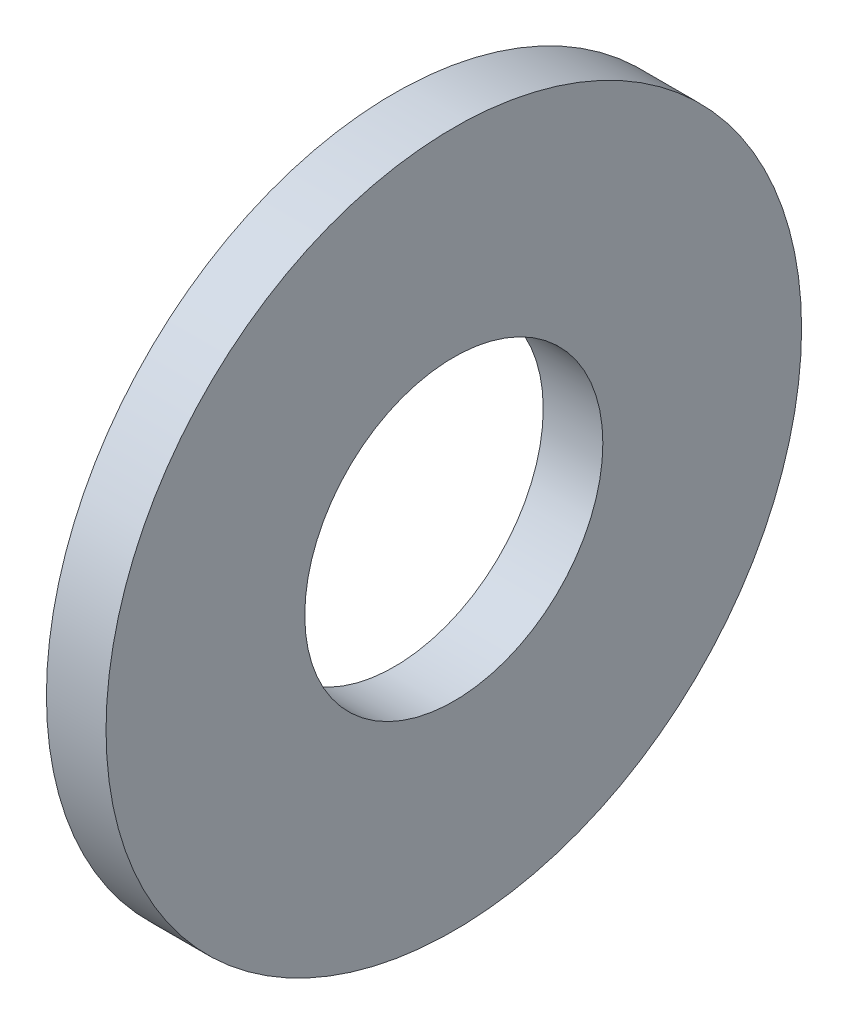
from build123d import *

# Parameters (mm, degrees)
SKETCH1_R           = 3.5
SKETCH1_R_2         = 1.5
BOSS_EXTRUDE1_DEPTH = 0.6


with BuildPart() as part:
    # Sketch1 → Boss-Extrude1 (new body)
    with BuildSketch(Plane.YZ):
        with Locations(Location((0, 0, 0), (0, 0, 270))):
            Circle(SKETCH1_R)
        with Locations(Location((0, 0, 0), (0, 0, 270))):
            Circle(SKETCH1_R_2, mode=Mode.SUBTRACT)
    extrude(amount=BOSS_EXTRUDE1_DEPTH)


solid = part.part
